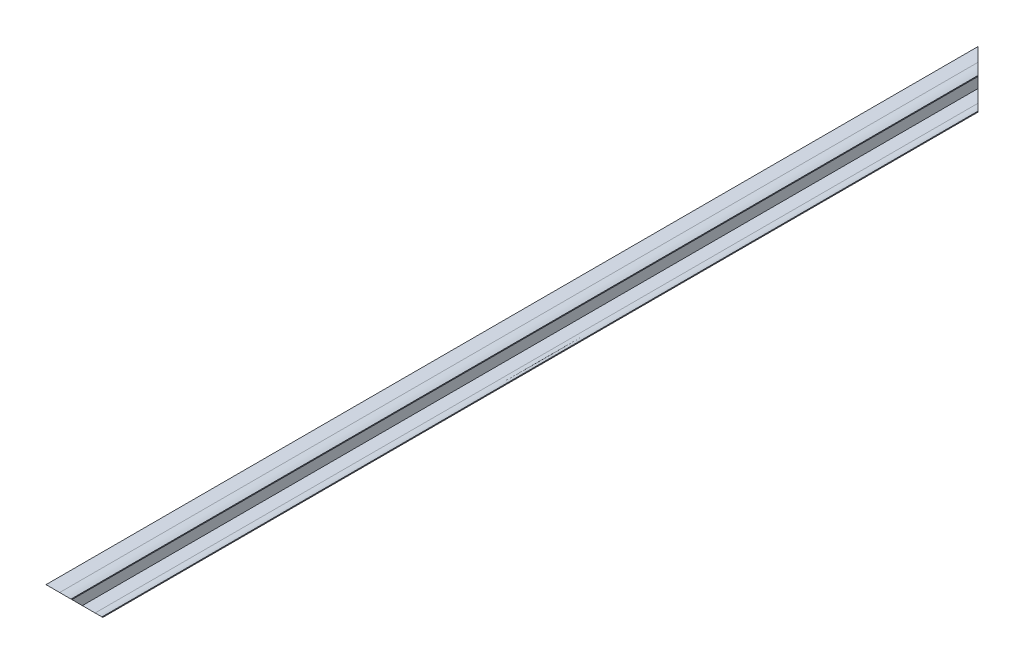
ISO-10303-21;
HEADER;
FILE_DESCRIPTION(('STEP AP214'),'2;1');
FILE_NAME('part.step','',(''),(''),'','','');
FILE_SCHEMA(('AUTOMOTIVE_DESIGN { 1 0 10303 214 1 1 1 1 }'));
ENDSEC;
DATA;
#1=APPLICATION_CONTEXT('core data for automotive mechanical design processes');
#2=APPLICATION_PROTOCOL_DEFINITION('international standard','automotive_design',2000,#1);
#3=PRODUCT_CONTEXT('',#1,'mechanical');
#4=PRODUCT('Part','Part','',(#3));
#5=PRODUCT_RELATED_PRODUCT_CATEGORY('part','',(#4));
#6=PRODUCT_DEFINITION_FORMATION('','',#4);
#7=PRODUCT_DEFINITION_CONTEXT('part definition',#1,'design');
#8=PRODUCT_DEFINITION('design','',#6,#7);
#9=PRODUCT_DEFINITION_SHAPE('','',#8);
#10=(LENGTH_UNIT() NAMED_UNIT(*) SI_UNIT(.MILLI.,.METRE.));
#11=(NAMED_UNIT(*) PLANE_ANGLE_UNIT() SI_UNIT($,.RADIAN.));
#12=(NAMED_UNIT(*) SI_UNIT($,.STERADIAN.) SOLID_ANGLE_UNIT());
#13=UNCERTAINTY_MEASURE_WITH_UNIT(LENGTH_MEASURE(1.E-05),#10,'distance_accuracy_value','');
#14=(GEOMETRIC_REPRESENTATION_CONTEXT(3) GLOBAL_UNCERTAINTY_ASSIGNED_CONTEXT((#13)) GLOBAL_UNIT_ASSIGNED_CONTEXT((#10,
#11,#12)) REPRESENTATION_CONTEXT('',''));
#15=CARTESIAN_POINT('',(0.,0.,0.));
#16=DIRECTION('',(0.,0.,1.));
#17=DIRECTION('',(1.,0.,0.));
#18=AXIS2_PLACEMENT_3D('',#15,#16,#17);
#19=CARTESIAN_POINT('',(0.,0.,2050.));
#20=DIRECTION('',(0.,1.,0.));
#21=DIRECTION('',(0.,0.,1.));
#22=AXIS2_PLACEMENT_3D('',#19,#20,#21);
#23=PLANE('',#22);
#24=DIRECTION('',(0.,0.,-1.));
#25=VECTOR('',#24,1.);
#26=CARTESIAN_POINT('',(30.,0.,2050.));
#27=LINE('',#26,#25);
#28=CARTESIAN_POINT('',(30.0000000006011,0.,1970.));
#29=VERTEX_POINT('',#28);
#30=CARTESIAN_POINT('',(30.,0.,30.0000000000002));
#31=VERTEX_POINT('',#30);
#32=EDGE_CURVE('E11',#29,#31,#27,.T.);
#33=ORIENTED_EDGE('',*,*,#32,.F.);
#34=DIRECTION('',(-1.,0.,0.));
#35=VECTOR('',#34,1.);
#36=CARTESIAN_POINT('',(50.00105,0.,1970.));
#37=LINE('',#36,#35);
#38=CARTESIAN_POINT('',(0.,0.,1970.));
#39=VERTEX_POINT('',#38);
#40=EDGE_CURVE('E137',#29,#39,#37,.T.);
#41=ORIENTED_EDGE('',*,*,#40,.T.);
#42=DIRECTION('',(0.,0.,-1.));
#43=VECTOR('',#42,1.);
#44=CARTESIAN_POINT('',(0.,0.,2050.));
#45=LINE('',#44,#43);
#46=CARTESIAN_POINT('',(0.,0.,0.));
#47=VERTEX_POINT('',#46);
#48=EDGE_CURVE('E128',#39,#47,#45,.T.);
#49=ORIENTED_EDGE('',*,*,#48,.T.);
#50=DIRECTION('',(-0.707106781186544,0.,-0.707106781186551));
#51=VECTOR('',#50,1.);
#52=CARTESIAN_POINT('',(0.,0.,0.));
#53=LINE('',#52,#51);
#54=EDGE_CURVE('E211',#31,#47,#53,.T.);
#55=ORIENTED_EDGE('',*,*,#54,.F.);
#56=EDGE_LOOP('',(#33,#41,#49,#55));
#57=FACE_BOUND('',#56,.T.);
#58=ADVANCED_FACE('F32',(#57),#23,.F.);
#59=CARTESIAN_POINT('',(30.,0.,2050.));
#60=CARTESIAN_POINT('',(40.6032812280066,0.0484567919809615,2050.));
#61=CARTESIAN_POINT('',(50.,5.,2050.));
#62=B_SPLINE_CURVE_WITH_KNOTS('',2,(#59,#60,#61),.UNSPECIFIED.,.F.,.F.,(3,3),(0.,1.),.UNSPECIFIED.);
#63=DIRECTION('',(0.,0.,-1.));
#64=VECTOR('',#63,1.);
#65=SURFACE_OF_LINEAR_EXTRUSION('',#62,#64);
#66=DIRECTION('',(0.,0.,-1.));
#67=VECTOR('',#66,1.);
#68=CARTESIAN_POINT('',(50.,5.,2050.));
#69=LINE('',#68,#67);
#70=CARTESIAN_POINT('',(50.,5.00000000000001,1975.));
#71=VERTEX_POINT('',#70);
#72=CARTESIAN_POINT('',(50.,5.,50.0000000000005));
#73=VERTEX_POINT('',#72);
#74=EDGE_CURVE('E46',#71,#73,#69,.T.);
#75=ORIENTED_EDGE('',*,*,#74,.F.);
#76=CARTESIAN_POINT('',(30.0000000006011,1.36626137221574E-12,1970.));
#77=CARTESIAN_POINT('',(30.2965221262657,0.00135208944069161,1970.00135208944));
#78=CARTESIAN_POINT('',(30.5930205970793,0.00558904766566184,1970.00558904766));
#79=CARTESIAN_POINT('',(31.1856963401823,0.0198889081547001,1970.01988890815));
#80=CARTESIAN_POINT('',(31.4818736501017,0.0299510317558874,1970.02995103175));
#81=CARTESIAN_POINT('',(32.0736889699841,0.055956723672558,1970.05595672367));
#82=CARTESIAN_POINT('',(32.3693270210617,0.0718998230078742,1970.07189982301));
#83=CARTESIAN_POINT('',(32.9597359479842,0.109694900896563,1970.1096949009));
#84=CARTESIAN_POINT('',(33.2545071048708,0.13154468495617,1970.13154468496));
#85=CARTESIAN_POINT('',(33.8430758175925,0.181175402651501,1970.18117540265));
#86=CARTESIAN_POINT('',(34.1368732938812,0.208956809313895,1970.20895680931));
#87=CARTESIAN_POINT('',(34.7232698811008,0.270449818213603,1970.27044981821));
#88=CARTESIAN_POINT('',(35.0158687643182,0.304162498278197,1970.30416249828));
#89=CARTESIAN_POINT('',(35.8889009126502,0.41384807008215,1970.41384807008));
#90=CARTESIAN_POINT('',(36.4671828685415,0.498588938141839,1970.49858893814));
#91=CARTESIAN_POINT('',(37.6162181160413,0.691147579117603,1970.69114757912));
#92=CARTESIAN_POINT('',(38.1869682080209,0.798974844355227,1970.79897484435));
#93=CARTESIAN_POINT('',(39.3191210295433,1.037016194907,1971.03701619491));
#94=CARTESIAN_POINT('',(39.8805226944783,1.16723281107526,1971.16723281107));
#95=CARTESIAN_POINT('',(40.9934871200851,1.44938335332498,1971.44938335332));
#96=CARTESIAN_POINT('',(41.5450291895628,1.60135802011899,1971.60135802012));
#97=CARTESIAN_POINT('',(42.6358830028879,1.92568946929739,1971.9256894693));
#98=CARTESIAN_POINT('',(43.1751963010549,2.09804364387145,1972.09804364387));
#99=CARTESIAN_POINT('',(44.240610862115,2.46185600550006,1972.4618560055));
#100=CARTESIAN_POINT('',(44.7667154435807,2.65330933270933,1972.65330933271));
#101=CARTESIAN_POINT('',(45.5602041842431,2.95948974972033,1972.95948974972));
#102=CARTESIAN_POINT('',(45.8325761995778,3.06781364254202,1973.06781364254));
#103=CARTESIAN_POINT('',(46.3733730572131,3.289211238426,1973.28921123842));
#104=CARTESIAN_POINT('',(46.6417986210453,3.40228405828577,1973.40228405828));
#105=CARTESIAN_POINT('',(47.1746722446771,3.63298659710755,1973.63298659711));
#106=CARTESIAN_POINT('',(47.4391205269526,3.75061605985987,1973.75061605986));
#107=CARTESIAN_POINT('',(48.4854647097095,4.22828118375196,1974.22828118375));
#108=CARTESIAN_POINT('',(49.2516390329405,4.60563986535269,1974.60563986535));
#109=CARTESIAN_POINT('',(50.,4.99999999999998,1975.));
#110=B_SPLINE_CURVE_WITH_KNOTS('',3,(#76,#77,#78,#79,#80,#81,#82,#83,#84,#85,#86,#87,#88,#89,
#90,#91,#92,#93,#94,#95,#96,#97,#98,#99,#100,#101,#102,#103,#104,#105,#106,#107,#108,#109),
.UNSPECIFIED.,.F.,.F.,(4,2,2,2,2,2,2,2,2,2,2,2,2,2,2,2,4),(0.,0.889560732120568,
1.77900258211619,2.66837351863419,3.5574144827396,4.44652637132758,5.33579999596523,
7.10646365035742,8.87785674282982,10.6494502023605,12.424405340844,14.199133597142,
15.9734114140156,16.9108234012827,17.8480618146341,18.785247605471,21.5842762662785),.UNSPECIFIED.);
#111=EDGE_CURVE('E160',#29,#71,#110,.T.);
#112=ORIENTED_EDGE('',*,*,#111,.F.);
#113=ORIENTED_EDGE('',*,*,#32,.T.);
#114=CARTESIAN_POINT('',(50.,4.99999999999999,50.0000000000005));
#115=CARTESIAN_POINT('',(49.4114796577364,4.68985586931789,49.4114796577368));
#116=CARTESIAN_POINT('',(48.8191807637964,4.39406911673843,48.8191807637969));
#117=CARTESIAN_POINT('',(47.6277425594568,3.83146471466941,47.6277425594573));
#118=CARTESIAN_POINT('',(47.0286032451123,3.56464708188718,47.0286032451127));
#119=CARTESIAN_POINT('',(45.8245910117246,3.06039872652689,45.824591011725));
#120=CARTESIAN_POINT('',(45.219722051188,2.82294911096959,45.2197220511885));
#121=CARTESIAN_POINT('',(44.0046502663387,2.37731903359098,44.0046502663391));
#122=CARTESIAN_POINT('',(43.394447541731,2.1691380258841,43.3944475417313));
#123=CARTESIAN_POINT('',(41.7405628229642,1.64647116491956,41.7405628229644));
#124=CARTESIAN_POINT('',(40.6924545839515,1.35958497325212,40.6924545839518));
#125=CARTESIAN_POINT('',(38.5864777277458,0.869149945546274,38.5864777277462));
#126=CARTESIAN_POINT('',(37.5286076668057,0.665613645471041,37.5286076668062));
#127=CARTESIAN_POINT('',(35.3936831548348,0.337784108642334,35.3936831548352));
#128=CARTESIAN_POINT('',(34.31655192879,0.214485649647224,34.3165519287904));
#129=CARTESIAN_POINT('',(32.6988221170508,0.0896672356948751,32.6988221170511));
#130=CARTESIAN_POINT('',(32.1592904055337,0.0580827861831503,32.159290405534));
#131=CARTESIAN_POINT('',(31.0798528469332,0.0144826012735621,31.0798528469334));
#132=CARTESIAN_POINT('',(30.5399470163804,0.00246605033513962,30.5399470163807));
#133=CARTESIAN_POINT('',(30.,0.,30.0000000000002));
#134=B_SPLINE_CURVE_WITH_KNOTS('',3,(#114,#115,#116,#117,#118,#119,#120,#121,#122,#123,#124,
#125,#126,#127,#128,#129,#130,#131,#132,#133),.UNSPECIFIED.,.F.,.F.,(4,2,2,2,2,2,2,2,2,4),(0.,
2.66446206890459,5.32892567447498,7.99166616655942,10.6543569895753,15.1809940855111,
19.7083117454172,24.2907399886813,26.5815270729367,28.8722186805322),.UNSPECIFIED.);
#135=EDGE_CURVE('E208',#73,#31,#134,.T.);
#136=ORIENTED_EDGE('',*,*,#135,.F.);
#137=EDGE_LOOP('',(#75,#112,#113,#136));
#138=FACE_BOUND('',#137,.T.);
#139=ADVANCED_FACE('F337',(#138),#65,.F.);
#140=CARTESIAN_POINT('',(50.,5.,2050.));
#141=DIRECTION('',(-1.,0.,0.));
#142=DIRECTION('',(0.,0.,1.));
#143=AXIS2_PLACEMENT_3D('',#140,#141,#142);
#144=PLANE('',#143);
#145=DIRECTION('',(0.,0.,-1.));
#146=VECTOR('',#145,1.);
#147=CARTESIAN_POINT('',(50.,7.00000000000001,2050.));
#148=LINE('',#147,#146);
#149=CARTESIAN_POINT('',(50.,7.00000000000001,1977.));
#150=VERTEX_POINT('',#149);
#151=CARTESIAN_POINT('',(50.,7.,50.0000000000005));
#152=VERTEX_POINT('',#151);
#153=EDGE_CURVE('E314',#150,#152,#148,.T.);
#154=ORIENTED_EDGE('',*,*,#153,.F.);
#155=DIRECTION('',(0.,0.707106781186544,0.707106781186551));
#156=VECTOR('',#155,1.);
#157=CARTESIAN_POINT('',(50.,80.,2050.));
#158=LINE('',#157,#156);
#159=EDGE_CURVE('E282',#71,#150,#158,.T.);
#160=ORIENTED_EDGE('',*,*,#159,.F.);
#161=ORIENTED_EDGE('',*,*,#74,.T.);
#162=DIRECTION('',(0.,1.,0.));
#163=VECTOR('',#162,1.);
#164=CARTESIAN_POINT('',(50.,-0.001000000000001,50.0000000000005));
#165=LINE('',#164,#163);
#166=EDGE_CURVE('E201',#73,#152,#165,.T.);
#167=ORIENTED_EDGE('',*,*,#166,.T.);
#168=EDGE_LOOP('',(#154,#160,#161,#167));
#169=FACE_BOUND('',#168,.T.);
#170=ADVANCED_FACE('F334',(#169),#144,.F.);
#171=CARTESIAN_POINT('',(50.,7.00000000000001,2050.));
#172=CARTESIAN_POINT('',(40.6032812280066,2.04845679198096,2050.));
#173=CARTESIAN_POINT('',(30.,2.,2050.));
#174=B_SPLINE_CURVE_WITH_KNOTS('',2,(#171,#172,#173),.UNSPECIFIED.,.F.,.F.,(3,3),(0.,1.),.UNSPECIFIED.);
#175=DIRECTION('',(0.,0.,-1.));
#176=VECTOR('',#175,1.);
#177=SURFACE_OF_LINEAR_EXTRUSION('',#174,#176);
#178=DIRECTION('',(0.,0.,-1.));
#179=VECTOR('',#178,1.);
#180=CARTESIAN_POINT('',(30.,2.,2050.));
#181=LINE('',#180,#179);
#182=CARTESIAN_POINT('',(30.,2.,1972.));
#183=VERTEX_POINT('',#182);
#184=CARTESIAN_POINT('',(30.,2.,30.0000000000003));
#185=VERTEX_POINT('',#184);
#186=EDGE_CURVE('E312',#183,#185,#181,.T.);
#187=ORIENTED_EDGE('',*,*,#186,.F.);
#188=CARTESIAN_POINT('',(50.,7.00000000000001,1977.));
#189=CARTESIAN_POINT('',(49.5210550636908,6.74761460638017,1976.74761460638));
#190=CARTESIAN_POINT('',(49.034728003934,6.50214773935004,1976.50214773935));
#191=CARTESIAN_POINT('',(48.0467010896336,6.02606279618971,1976.02606279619));
#192=CARTESIAN_POINT('',(47.5449794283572,5.7954673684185,1975.79546736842));
#193=CARTESIAN_POINT('',(46.52672911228,5.35078644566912,1975.35078644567));
#194=CARTESIAN_POINT('',(46.0101932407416,5.13670919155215,1975.13670919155));
#195=CARTESIAN_POINT('',(44.9634416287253,4.72679072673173,1974.72679072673));
#196=CARTESIAN_POINT('',(44.4332389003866,4.53093293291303,1974.53093293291));
#197=CARTESIAN_POINT('',(43.3596325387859,4.15871016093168,1974.15871016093));
#198=CARTESIAN_POINT('',(42.8162357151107,3.98233537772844,1973.98233537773));
#199=CARTESIAN_POINT('',(41.7171702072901,3.65035131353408,1973.65035131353));
#200=CARTESIAN_POINT('',(41.1615076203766,3.49473197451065,1973.49473197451));
#201=CARTESIAN_POINT('',(40.1825845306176,3.24237137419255,1973.24237137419));
#202=CARTESIAN_POINT('',(39.7618260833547,3.14075340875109,1973.14075340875));
#203=CARTESIAN_POINT('',(38.9146879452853,2.95002496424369,1972.95002496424));
#204=CARTESIAN_POINT('',(38.4883085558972,2.86091381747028,1972.86091381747));
#205=CARTESIAN_POINT('',(37.6310401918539,2.69562554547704,1972.69562554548));
#206=CARTESIAN_POINT('',(37.2001563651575,2.61943507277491,1972.61943507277));
#207=CARTESIAN_POINT('',(36.3341748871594,2.4801321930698,1972.48013219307));
#208=CARTESIAN_POINT('',(35.8990771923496,2.41701992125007,1972.41701992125));
#209=CARTESIAN_POINT('',(35.0123765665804,2.30235066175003,1972.30235066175));
#210=CARTESIAN_POINT('',(34.5606694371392,2.25119612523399,1972.25119612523));
#211=CARTESIAN_POINT('',(33.6544975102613,2.16301119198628,1972.16301119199));
#212=CARTESIAN_POINT('',(33.2000326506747,2.12598111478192,1972.12598111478));
#213=CARTESIAN_POINT('',(32.2884626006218,2.0659644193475,1972.06596441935));
#214=CARTESIAN_POINT('',(31.831354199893,2.04300224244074,1972.04300224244));
#215=CARTESIAN_POINT('',(30.9161801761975,2.01105819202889,1972.01105819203));
#216=CARTESIAN_POINT('',(30.4581145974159,2.00207568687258,1972.00207568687));
#217=CARTESIAN_POINT('',(30.,2.00000000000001,1972.));
#218=B_SPLINE_CURVE_WITH_KNOTS('',3,(#188,#189,#190,#191,#192,#193,#194,#195,#196,#197,#198,
#199,#200,#201,#202,#203,#204,#205,#206,#207,#208,#209,#210,#211,#212,#213,#214,#215,#216,#217),
.UNSPECIFIED.,.F.,.F.,(4,2,2,2,2,2,2,2,2,2,2,2,2,2,4),(0.,1.79192712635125,3.58652177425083,
5.38200602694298,7.17583972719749,8.96876650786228,10.7608212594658,12.094332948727,
13.4277734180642,14.759827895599,16.0918961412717,17.463838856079,18.8358126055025,
20.2101632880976,21.5844518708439),.UNSPECIFIED.);
#219=EDGE_CURVE('E284',#150,#183,#218,.T.);
#220=ORIENTED_EDGE('',*,*,#219,.F.);
#221=ORIENTED_EDGE('',*,*,#153,.T.);
#222=CARTESIAN_POINT('',(30.,2.,30.0000000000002));
#223=CARTESIAN_POINT('',(30.6272946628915,2.00285611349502,30.6272946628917));
#224=CARTESIAN_POINT('',(31.2545746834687,2.01861799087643,31.254574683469));
#225=CARTESIAN_POINT('',(32.5085722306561,2.07665376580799,32.5085722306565));
#226=CARTESIAN_POINT('',(33.1352897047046,2.11892992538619,33.1352897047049));
#227=CARTESIAN_POINT('',(34.3876637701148,2.23070718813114,34.3876637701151));
#228=CARTESIAN_POINT('',(35.0133200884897,2.30021446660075,35.01332008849));
#229=CARTESIAN_POINT('',(36.2627376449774,2.46704639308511,36.2627376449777));
#230=CARTESIAN_POINT('',(36.8864989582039,2.56436992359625,36.8864989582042));
#231=CARTESIAN_POINT('',(38.5675300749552,2.86547237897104,38.5675300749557));
#232=CARTESIAN_POINT('',(39.6224623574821,3.09607135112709,39.6224623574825));
#233=CARTESIAN_POINT('',(41.7212568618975,3.64106978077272,41.7212568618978));
#234=CARTESIAN_POINT('',(42.7651214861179,3.95545064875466,42.765121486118));
#235=CARTESIAN_POINT('',(44.3267724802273,4.4927596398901,44.3267724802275));
#236=CARTESIAN_POINT('',(44.8500436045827,4.68429385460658,44.8500436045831));
#237=CARTESIAN_POINT('',(45.892392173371,5.08904722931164,45.8923921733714));
#238=CARTESIAN_POINT('',(46.4114696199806,5.30226637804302,46.4114696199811));
#239=CARTESIAN_POINT('',(47.4451599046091,5.75040246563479,47.4451599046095));
#240=CARTESIAN_POINT('',(47.9597707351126,5.98532865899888,47.959770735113));
#241=CARTESIAN_POINT('',(48.9838539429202,6.47662567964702,48.9838539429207));
#242=CARTESIAN_POINT('',(49.4933262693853,6.7329967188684,49.4933262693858));
#243=CARTESIAN_POINT('',(50.,7.00000000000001,50.0000000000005));
#244=B_SPLINE_CURVE_WITH_KNOTS('',3,(#222,#223,#224,#225,#226,#227,#228,#229,#230,#231,#232,
#233,#234,#235,#236,#237,#238,#239,#240,#241,#242,#243),.UNSPECIFIED.,.F.,.F.,(4,2,2,2,2,2,2,2,
2,2,4),(0.,2.66133520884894,5.32289749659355,7.98506370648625,10.6471229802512,15.1735338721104,
19.6989412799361,21.9918706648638,24.2847988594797,26.5787091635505,28.8726421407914),.UNSPECIFIED.);
#245=EDGE_CURVE('E212',#185,#152,#244,.T.);
#246=ORIENTED_EDGE('',*,*,#245,.F.);
#247=EDGE_LOOP('',(#187,#220,#221,#246));
#248=FACE_BOUND('',#247,.T.);
#249=ADVANCED_FACE('F376',(#248),#177,.F.);
#250=CARTESIAN_POINT('',(2.,2.,2050.));
#251=DIRECTION('',(0.,-1.,0.));
#252=DIRECTION('',(0.,0.,-1.));
#253=AXIS2_PLACEMENT_3D('',#250,#251,#252);
#254=PLANE('',#253);
#255=DIRECTION('',(0.,0.,-1.));
#256=VECTOR('',#255,1.);
#257=CARTESIAN_POINT('',(2.,2.,2050.));
#258=LINE('',#257,#256);
#259=CARTESIAN_POINT('',(2.,2.,1972.));
#260=VERTEX_POINT('',#259);
#261=CARTESIAN_POINT('',(2.,2.,2.00000000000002));
#262=VERTEX_POINT('',#261);
#263=EDGE_CURVE('E305',#260,#262,#258,.T.);
#264=ORIENTED_EDGE('',*,*,#263,.F.);
#265=DIRECTION('',(-1.,0.,0.));
#266=VECTOR('',#265,1.);
#267=CARTESIAN_POINT('',(50.00105,2.,1972.));
#268=LINE('',#267,#266);
#269=EDGE_CURVE('E236',#183,#260,#268,.T.);
#270=ORIENTED_EDGE('',*,*,#269,.F.);
#271=ORIENTED_EDGE('',*,*,#186,.T.);
#272=DIRECTION('',(0.707106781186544,0.,0.707106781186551));
#273=VECTOR('',#272,1.);
#274=CARTESIAN_POINT('',(0.,2.,0.));
#275=LINE('',#274,#273);
#276=EDGE_CURVE('E311',#262,#185,#275,.T.);
#277=ORIENTED_EDGE('',*,*,#276,.F.);
#278=EDGE_LOOP('',(#264,#270,#271,#277));
#279=FACE_BOUND('',#278,.T.);
#280=ADVANCED_FACE('F309',(#279),#254,.F.);
#281=CARTESIAN_POINT('',(2.,78.,2050.));
#282=DIRECTION('',(-1.,0.,0.));
#283=DIRECTION('',(0.,0.,1.));
#284=AXIS2_PLACEMENT_3D('',#281,#282,#283);
#285=PLANE('',#284);
#286=DIRECTION('',(0.,0.,-1.));
#287=VECTOR('',#286,1.);
#288=CARTESIAN_POINT('',(2.,78.,2050.));
#289=LINE('',#288,#287);
#290=CARTESIAN_POINT('',(2.,78.,2048.));
#291=VERTEX_POINT('',#290);
#292=CARTESIAN_POINT('',(2.,78.,2.00000000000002));
#293=VERTEX_POINT('',#292);
#294=EDGE_CURVE('E307',#291,#293,#289,.T.);
#295=ORIENTED_EDGE('',*,*,#294,.F.);
#296=DIRECTION('',(0.,0.707106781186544,0.707106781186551));
#297=VECTOR('',#296,1.);
#298=CARTESIAN_POINT('',(2.,80.,2050.));
#299=LINE('',#298,#297);
#300=EDGE_CURVE('E226',#260,#291,#299,.T.);
#301=ORIENTED_EDGE('',*,*,#300,.F.);
#302=ORIENTED_EDGE('',*,*,#263,.T.);
#303=DIRECTION('',(0.,-1.,0.));
#304=VECTOR('',#303,1.);
#305=CARTESIAN_POINT('',(2.,-0.001000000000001,2.00000000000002));
#306=LINE('',#305,#304);
#307=EDGE_CURVE('E194',#293,#262,#306,.T.);
#308=ORIENTED_EDGE('',*,*,#307,.F.);
#309=EDGE_LOOP('',(#295,#301,#302,#308));
#310=FACE_BOUND('',#309,.T.);
#311=ADVANCED_FACE('F303',(#310),#285,.F.);
#312=CARTESIAN_POINT('',(2.,78.,2050.));
#313=DIRECTION('',(0.,1.,0.));
#314=DIRECTION('',(0.,0.,1.));
#315=AXIS2_PLACEMENT_3D('',#312,#313,#314);
#316=PLANE('',#315);
#317=DIRECTION('',(0.,0.,-1.));
#318=VECTOR('',#317,1.);
#319=CARTESIAN_POINT('',(30.,78.,2050.));
#320=LINE('',#319,#318);
#321=CARTESIAN_POINT('',(30.,78.,2048.));
#322=VERTEX_POINT('',#321);
#323=CARTESIAN_POINT('',(30.,78.,30.0000000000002));
#324=VERTEX_POINT('',#323);
#325=EDGE_CURVE('E316',#322,#324,#320,.T.);
#326=ORIENTED_EDGE('',*,*,#325,.F.);
#327=DIRECTION('',(1.,0.,0.));
#328=VECTOR('',#327,1.);
#329=CARTESIAN_POINT('',(50.00105,78.,2048.));
#330=LINE('',#329,#328);
#331=EDGE_CURVE('E237',#291,#322,#330,.T.);
#332=ORIENTED_EDGE('',*,*,#331,.F.);
#333=ORIENTED_EDGE('',*,*,#294,.T.);
#334=DIRECTION('',(-0.707106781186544,0.,-0.707106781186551));
#335=VECTOR('',#334,1.);
#336=CARTESIAN_POINT('',(0.,78.,0.));
#337=LINE('',#336,#335);
#338=EDGE_CURVE('E486',#324,#293,#337,.T.);
#339=ORIENTED_EDGE('',*,*,#338,.F.);
#340=EDGE_LOOP('',(#326,#332,#333,#339));
#341=FACE_BOUND('',#340,.T.);
#342=ADVANCED_FACE('F367',(#341),#316,.F.);
#343=CARTESIAN_POINT('',(30.,78.,2050.));
#344=CARTESIAN_POINT('',(40.6032812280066,77.951543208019,2050.));
#345=CARTESIAN_POINT('',(50.,73.,2050.));
#346=B_SPLINE_CURVE_WITH_KNOTS('',2,(#343,#344,#345),.UNSPECIFIED.,.F.,.F.,(3,3),(0.,1.),.UNSPECIFIED.);
#347=DIRECTION('',(0.,0.,-1.));
#348=VECTOR('',#347,1.);
#349=SURFACE_OF_LINEAR_EXTRUSION('',#346,#348);
#350=DIRECTION('',(0.,0.,-1.));
#351=VECTOR('',#350,1.);
#352=CARTESIAN_POINT('',(50.,73.,2050.));
#353=LINE('',#352,#351);
#354=CARTESIAN_POINT('',(50.,73.,2043.));
#355=VERTEX_POINT('',#354);
#356=CARTESIAN_POINT('',(50.,73.,50.0000000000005));
#357=VERTEX_POINT('',#356);
#358=EDGE_CURVE('E509',#355,#357,#353,.T.);
#359=ORIENTED_EDGE('',*,*,#358,.F.);
#360=CARTESIAN_POINT('',(30.,78.,2048.));
#361=CARTESIAN_POINT('',(30.2965221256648,77.9986479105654,2047.99864791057));
#362=CARTESIAN_POINT('',(30.5930205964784,77.9944109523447,2047.99441095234));
#363=CARTESIAN_POINT('',(31.1856963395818,77.9801110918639,2047.98011109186));
#364=CARTESIAN_POINT('',(31.4818736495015,77.9700489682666,2047.97004896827));
#365=CARTESIAN_POINT('',(32.0736889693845,77.9440432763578,2047.94404327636));
#366=CARTESIAN_POINT('',(32.3693270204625,77.9281001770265,2047.92810017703));
#367=CARTESIAN_POINT('',(32.959735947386,77.8903050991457,2047.89030509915));
#368=CARTESIAN_POINT('',(33.2545071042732,77.8684553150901,2047.86845531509));
#369=CARTESIAN_POINT('',(33.8430758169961,77.8188245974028,2047.8188245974));
#370=CARTESIAN_POINT('',(34.1368732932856,77.7910431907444,2047.79104319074));
#371=CARTESIAN_POINT('',(34.7232698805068,77.7295501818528,2047.72955018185));
#372=CARTESIAN_POINT('',(35.0158687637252,77.6958375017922,2047.69583750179));
#373=CARTESIAN_POINT('',(35.8889009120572,77.5861519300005,2047.58615193));
#374=CARTESIAN_POINT('',(36.467182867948,77.5014110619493,2047.50141106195));
#375=CARTESIAN_POINT('',(37.6162181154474,77.3088524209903,2047.30885242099));
#376=CARTESIAN_POINT('',(38.186968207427,77.2010251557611,2047.20102515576));
#377=CARTESIAN_POINT('',(39.3191210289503,76.9629838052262,2046.96298380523));
#378=CARTESIAN_POINT('',(39.8805226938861,76.8327671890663,2046.83276718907));
#379=CARTESIAN_POINT('',(40.9934871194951,76.5506166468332,2046.55061664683));
#380=CARTESIAN_POINT('',(41.5450291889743,76.3986419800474,2046.39864198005));
#381=CARTESIAN_POINT('',(42.6358830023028,76.0743105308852,2046.07431053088));
#382=CARTESIAN_POINT('',(43.1751963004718,75.9019563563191,2045.90195635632));
#383=CARTESIAN_POINT('',(44.2406108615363,75.5381439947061,2045.53814399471));
#384=CARTESIAN_POINT('',(44.7667154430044,75.3466906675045,2045.3466906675));
#385=CARTESIAN_POINT('',(45.5602041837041,75.0405102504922,2045.04051025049));
#386=CARTESIAN_POINT('',(45.832576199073,74.932186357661,2044.93218635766));
#387=CARTESIAN_POINT('',(46.3733730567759,74.7107887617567,2044.71078876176));
#388=CARTESIAN_POINT('',(46.6417986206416,74.5977159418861,2044.59771594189));
#389=CARTESIAN_POINT('',(47.1746722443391,74.3670134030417,2044.36701340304));
#390=CARTESIAN_POINT('',(47.439120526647,74.2493839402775,2044.24938394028));
#391=CARTESIAN_POINT('',(48.4854647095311,73.7717188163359,2043.77171881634));
#392=CARTESIAN_POINT('',(49.2516390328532,73.3943601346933,2043.39436013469));
#393=CARTESIAN_POINT('',(50.,73.,2043.));
#394=B_SPLINE_CURVE_WITH_KNOTS('',3,(#360,#361,#362,#363,#364,#365,#366,#367,#368,#369,#370,
#371,#372,#373,#374,#375,#376,#377,#378,#379,#380,#381,#382,#383,#384,#385,#386,#387,#388,#389,
#390,#391,#392,#393),.UNSPECIFIED.,.F.,.F.,(4,2,2,2,2,2,2,2,2,2,2,2,2,2,2,2,4),(0.,
0.889560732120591,1.77900258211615,2.66837351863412,3.55741448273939,4.44652637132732,
5.33579999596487,7.10646365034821,8.87785674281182,10.6494502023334,12.4244053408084,
14.1991335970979,15.9734114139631,16.9108234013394,17.8480618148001,18.7852476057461,
21.5842762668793),.UNSPECIFIED.);
#395=EDGE_CURVE('E262',#322,#355,#394,.T.);
#396=ORIENTED_EDGE('',*,*,#395,.F.);
#397=ORIENTED_EDGE('',*,*,#325,.T.);
#398=CARTESIAN_POINT('',(50.,73.,50.0000000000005));
#399=CARTESIAN_POINT('',(49.4114796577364,73.3101441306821,49.4114796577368));
#400=CARTESIAN_POINT('',(48.8191807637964,73.6059308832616,48.8191807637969));
#401=CARTESIAN_POINT('',(47.6277425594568,74.1685352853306,47.6277425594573));
#402=CARTESIAN_POINT('',(47.0286032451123,74.4353529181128,47.0286032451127));
#403=CARTESIAN_POINT('',(45.8245910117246,74.9396012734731,45.824591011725));
#404=CARTESIAN_POINT('',(45.219722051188,75.1770508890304,45.2197220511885));
#405=CARTESIAN_POINT('',(44.0046502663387,75.622680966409,44.0046502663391));
#406=CARTESIAN_POINT('',(43.394447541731,75.8308619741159,43.3944475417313));
#407=CARTESIAN_POINT('',(41.7405628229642,76.3535288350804,41.7405628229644));
#408=CARTESIAN_POINT('',(40.6924545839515,76.6404150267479,40.6924545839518));
#409=CARTESIAN_POINT('',(38.5864777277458,77.1308500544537,38.5864777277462));
#410=CARTESIAN_POINT('',(37.5286076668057,77.334386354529,37.5286076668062));
#411=CARTESIAN_POINT('',(35.3936831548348,77.6622158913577,35.3936831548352));
#412=CARTESIAN_POINT('',(34.31655192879,77.7855143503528,34.3165519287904));
#413=CARTESIAN_POINT('',(32.6988221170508,77.9103327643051,32.6988221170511));
#414=CARTESIAN_POINT('',(32.1592904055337,77.9419172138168,32.159290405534));
#415=CARTESIAN_POINT('',(31.0798528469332,77.9855173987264,31.0798528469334));
#416=CARTESIAN_POINT('',(30.5399470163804,77.9975339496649,30.5399470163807));
#417=CARTESIAN_POINT('',(30.,78.,30.0000000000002));
#418=B_SPLINE_CURVE_WITH_KNOTS('',3,(#398,#399,#400,#401,#402,#403,#404,#405,#406,#407,#408,
#409,#410,#411,#412,#413,#414,#415,#416,#417),.UNSPECIFIED.,.F.,.F.,(4,2,2,2,2,2,2,2,2,4),(0.,
2.6644620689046,5.32892567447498,7.99166616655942,10.6543569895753,15.1809940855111,
19.7083117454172,24.2907399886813,26.5815270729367,28.8722186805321),.UNSPECIFIED.);
#419=EDGE_CURVE('E205',#357,#324,#418,.T.);
#420=ORIENTED_EDGE('',*,*,#419,.F.);
#421=EDGE_LOOP('',(#359,#396,#397,#420));
#422=FACE_BOUND('',#421,.T.);
#423=ADVANCED_FACE('F363',(#422),#349,.F.);
#424=CARTESIAN_POINT('',(50.,75.,2050.));
#425=DIRECTION('',(-1.,0.,0.));
#426=DIRECTION('',(0.,0.,1.));
#427=AXIS2_PLACEMENT_3D('',#424,#425,#426);
#428=PLANE('',#427);
#429=DIRECTION('',(0.,0.,-1.));
#430=VECTOR('',#429,1.);
#431=CARTESIAN_POINT('',(50.,75.,2050.));
#432=LINE('',#431,#430);
#433=CARTESIAN_POINT('',(50.,75.,2045.));
#434=VERTEX_POINT('',#433);
#435=CARTESIAN_POINT('',(50.,75.,50.0000000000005));
#436=VERTEX_POINT('',#435);
#437=EDGE_CURVE('E144',#434,#436,#432,.T.);
#438=ORIENTED_EDGE('',*,*,#437,.F.);
#439=DIRECTION('',(0.,0.707106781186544,0.707106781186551));
#440=VECTOR('',#439,1.);
#441=CARTESIAN_POINT('',(50.,80.,2050.));
#442=LINE('',#441,#440);
#443=EDGE_CURVE('E267',#355,#434,#442,.T.);
#444=ORIENTED_EDGE('',*,*,#443,.F.);
#445=ORIENTED_EDGE('',*,*,#358,.T.);
#446=EDGE_CURVE('E198',#357,#436,#165,.T.);
#447=ORIENTED_EDGE('',*,*,#446,.T.);
#448=EDGE_LOOP('',(#438,#444,#445,#447));
#449=FACE_BOUND('',#448,.T.);
#450=ADVANCED_FACE('F359',(#449),#428,.F.);
#451=CARTESIAN_POINT('',(50.,75.,2050.));
#452=CARTESIAN_POINT('',(40.6032812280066,79.951543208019,2050.));
#453=CARTESIAN_POINT('',(30.,80.,2050.));
#454=B_SPLINE_CURVE_WITH_KNOTS('',2,(#451,#452,#453),.UNSPECIFIED.,.F.,.F.,(3,3),(0.,1.),.UNSPECIFIED.);
#455=DIRECTION('',(0.,0.,-1.));
#456=VECTOR('',#455,1.);
#457=SURFACE_OF_LINEAR_EXTRUSION('',#454,#456);
#458=DIRECTION('',(0.,0.,-1.));
#459=VECTOR('',#458,1.);
#460=CARTESIAN_POINT('',(30.,80.,2050.));
#461=LINE('',#460,#459);
#462=CARTESIAN_POINT('',(30.,80.,2050.));
#463=VERTEX_POINT('',#462);
#464=CARTESIAN_POINT('',(30.,80.,30.0000000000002));
#465=VERTEX_POINT('',#464);
#466=EDGE_CURVE('E142',#463,#465,#461,.T.);
#467=ORIENTED_EDGE('',*,*,#466,.F.);
#468=CARTESIAN_POINT('',(50.,75.,2045.));
#469=CARTESIAN_POINT('',(49.5210550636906,75.2523853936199,2045.25238539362));
#470=CARTESIAN_POINT('',(49.0347280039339,75.49785226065,2045.49785226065));
#471=CARTESIAN_POINT('',(48.0467010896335,75.9739372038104,2045.97393720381));
#472=CARTESIAN_POINT('',(47.5449794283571,76.2045326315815,2046.20453263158));
#473=CARTESIAN_POINT('',(46.5267291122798,76.6492135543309,2046.64921355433));
#474=CARTESIAN_POINT('',(46.0101932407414,76.8632908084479,2046.86329080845));
#475=CARTESIAN_POINT('',(44.9634416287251,77.2732092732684,2047.27320927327));
#476=CARTESIAN_POINT('',(44.4332389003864,77.4690670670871,2047.46906706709));
#477=CARTESIAN_POINT('',(43.3596325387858,77.8412898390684,2047.84128983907));
#478=CARTESIAN_POINT('',(42.8162357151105,78.0176646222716,2048.01766462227));
#479=CARTESIAN_POINT('',(41.71717020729,78.3496486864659,2048.34964868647));
#480=CARTESIAN_POINT('',(41.1615076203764,78.5052680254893,2048.50526802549));
#481=CARTESIAN_POINT('',(40.1825845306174,78.7576286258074,2048.75762862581));
#482=CARTESIAN_POINT('',(39.7618260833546,78.8592465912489,2048.85924659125));
#483=CARTESIAN_POINT('',(38.9146879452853,79.0499750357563,2049.04997503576));
#484=CARTESIAN_POINT('',(38.4883085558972,79.1390861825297,2049.13908618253));
#485=CARTESIAN_POINT('',(37.631040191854,79.3043744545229,2049.30437445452));
#486=CARTESIAN_POINT('',(37.2001563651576,79.3805649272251,2049.38056492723));
#487=CARTESIAN_POINT('',(36.3341748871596,79.5198678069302,2049.51986780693));
#488=CARTESIAN_POINT('',(35.8990771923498,79.58298007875,2049.58298007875));
#489=CARTESIAN_POINT('',(35.0123765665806,79.6976493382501,2049.69764933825));
#490=CARTESIAN_POINT('',(34.5606694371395,79.748803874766,2049.74880387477));
#491=CARTESIAN_POINT('',(33.6544975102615,79.8369888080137,2049.83698880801));
#492=CARTESIAN_POINT('',(33.2000326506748,79.8740188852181,2049.87401888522));
#493=CARTESIAN_POINT('',(32.2884626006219,79.9340355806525,2049.93403558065));
#494=CARTESIAN_POINT('',(31.8313541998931,79.9569977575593,2049.95699775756));
#495=CARTESIAN_POINT('',(30.9161801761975,79.9889418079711,2049.98894180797));
#496=CARTESIAN_POINT('',(30.4581145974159,79.9979243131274,2049.99792431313));
#497=CARTESIAN_POINT('',(30.,80.,2050.));
#498=B_SPLINE_CURVE_WITH_KNOTS('',3,(#468,#469,#470,#471,#472,#473,#474,#475,#476,#477,#478,
#479,#480,#481,#482,#483,#484,#485,#486,#487,#488,#489,#490,#491,#492,#493,#494,#495,#496,#497),
.UNSPECIFIED.,.F.,.F.,(4,2,2,2,2,2,2,2,2,2,2,2,2,2,4),(0.,1.79192712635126,3.58652177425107,
5.38200602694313,7.17583972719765,8.96876650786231,10.760821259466,12.0943329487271,
13.4277734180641,14.7598278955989,16.0918961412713,17.4638388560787,18.8358126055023,
20.2101632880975,21.5844518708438),.UNSPECIFIED.);
#499=EDGE_CURVE('E53',#434,#463,#498,.T.);
#500=ORIENTED_EDGE('',*,*,#499,.F.);
#501=ORIENTED_EDGE('',*,*,#437,.T.);
#502=CARTESIAN_POINT('',(30.,80.,30.0000000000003));
#503=CARTESIAN_POINT('',(30.6272946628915,79.997143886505,30.6272946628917));
#504=CARTESIAN_POINT('',(31.2545746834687,79.9813820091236,31.254574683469));
#505=CARTESIAN_POINT('',(32.5085722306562,79.923346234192,32.5085722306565));
#506=CARTESIAN_POINT('',(33.1352897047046,79.8810700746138,33.1352897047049));
#507=CARTESIAN_POINT('',(34.3876637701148,79.7692928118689,34.3876637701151));
#508=CARTESIAN_POINT('',(35.0133200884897,79.6997855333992,35.01332008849));
#509=CARTESIAN_POINT('',(36.2627376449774,79.5329536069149,36.2627376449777));
#510=CARTESIAN_POINT('',(36.8864989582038,79.4356300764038,36.8864989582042));
#511=CARTESIAN_POINT('',(38.5675300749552,79.134527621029,38.5675300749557));
#512=CARTESIAN_POINT('',(39.6224623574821,78.9039286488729,39.6224623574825));
#513=CARTESIAN_POINT('',(41.7212568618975,78.3589302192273,41.7212568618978));
#514=CARTESIAN_POINT('',(42.7651214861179,78.0445493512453,42.765121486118));
#515=CARTESIAN_POINT('',(44.3267724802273,77.5072403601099,44.3267724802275));
#516=CARTESIAN_POINT('',(44.8500436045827,77.3157061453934,44.8500436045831));
#517=CARTESIAN_POINT('',(45.892392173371,76.9109527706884,45.8923921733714));
#518=CARTESIAN_POINT('',(46.4114696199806,76.697733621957,46.4114696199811));
#519=CARTESIAN_POINT('',(47.4451599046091,76.2495975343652,47.4451599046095));
#520=CARTESIAN_POINT('',(47.9597707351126,76.0146713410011,47.959770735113));
#521=CARTESIAN_POINT('',(48.9838539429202,75.523374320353,48.9838539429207));
#522=CARTESIAN_POINT('',(49.4933262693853,75.2670032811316,49.4933262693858));
#523=CARTESIAN_POINT('',(50.,75.,50.0000000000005));
#524=B_SPLINE_CURVE_WITH_KNOTS('',3,(#502,#503,#504,#505,#506,#507,#508,#509,#510,#511,#512,
#513,#514,#515,#516,#517,#518,#519,#520,#521,#522,#523),.UNSPECIFIED.,.F.,.F.,(4,2,2,2,2,2,2,2,
2,2,4),(0.,2.66133520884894,5.32289749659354,7.98506370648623,10.6471229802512,15.1735338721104,
19.6989412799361,21.9918706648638,24.2847988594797,26.5787091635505,28.8726421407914),.UNSPECIFIED.);
#525=EDGE_CURVE('E157',#465,#436,#524,.T.);
#526=ORIENTED_EDGE('',*,*,#525,.F.);
#527=EDGE_LOOP('',(#467,#500,#501,#526));
#528=FACE_BOUND('',#527,.T.);
#529=ADVANCED_FACE('F355',(#528),#457,.F.);
#530=CARTESIAN_POINT('',(0.,80.,2050.));
#531=DIRECTION('',(0.,-1.,0.));
#532=DIRECTION('',(0.,0.,-1.));
#533=AXIS2_PLACEMENT_3D('',#530,#531,#532);
#534=PLANE('',#533);
#535=ORIENTED_EDGE('',*,*,#466,.T.);
#536=DIRECTION('',(0.707106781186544,0.,0.707106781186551));
#537=VECTOR('',#536,1.);
#538=CARTESIAN_POINT('',(0.,80.,0.));
#539=LINE('',#538,#537);
#540=CARTESIAN_POINT('',(0.,80.,0.));
#541=VERTEX_POINT('',#540);
#542=EDGE_CURVE('E141',#541,#465,#539,.T.);
#543=ORIENTED_EDGE('',*,*,#542,.F.);
#544=DIRECTION('',(0.,0.,-1.));
#545=VECTOR('',#544,1.);
#546=CARTESIAN_POINT('',(0.,80.,2050.));
#547=LINE('',#546,#545);
#548=CARTESIAN_POINT('',(0.,80.,2050.));
#549=VERTEX_POINT('',#548);
#550=EDGE_CURVE('E136',#549,#541,#547,.T.);
#551=ORIENTED_EDGE('',*,*,#550,.F.);
#552=DIRECTION('',(-1.,0.,0.));
#553=VECTOR('',#552,1.);
#554=CARTESIAN_POINT('',(0.,80.,2050.));
#555=LINE('',#554,#553);
#556=EDGE_CURVE('E120',#463,#549,#555,.T.);
#557=ORIENTED_EDGE('',*,*,#556,.F.);
#558=EDGE_LOOP('',(#535,#543,#551,#557));
#559=FACE_BOUND('',#558,.T.);
#560=ADVANCED_FACE('F140',(#559),#534,.F.);
#561=CARTESIAN_POINT('',(0.,0.,2050.));
#562=DIRECTION('',(1.,0.,0.));
#563=DIRECTION('',(0.,0.,-1.));
#564=AXIS2_PLACEMENT_3D('',#561,#562,#563);
#565=PLANE('',#564);
#566=ORIENTED_EDGE('',*,*,#48,.F.);
#567=DIRECTION('',(0.,-0.707106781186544,-0.707106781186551));
#568=VECTOR('',#567,1.);
#569=CARTESIAN_POINT('',(0.,80.,2050.));
#570=LINE('',#569,#568);
#571=EDGE_CURVE('E123',#549,#39,#570,.T.);
#572=ORIENTED_EDGE('',*,*,#571,.F.);
#573=ORIENTED_EDGE('',*,*,#550,.T.);
#574=DIRECTION('',(0.,-1.,0.));
#575=VECTOR('',#574,1.);
#576=CARTESIAN_POINT('',(0.,0.,0.));
#577=LINE('',#576,#575);
#578=EDGE_CURVE('E129',#541,#47,#577,.T.);
#579=ORIENTED_EDGE('',*,*,#578,.T.);
#580=EDGE_LOOP('',(#566,#572,#573,#579));
#581=FACE_BOUND('',#580,.T.);
#582=ADVANCED_FACE('F134',(#581),#565,.F.);
#583=CARTESIAN_POINT('',(0.,-0.001000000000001,0.));
#584=DIRECTION('',(-0.707106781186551,0.,0.707106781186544));
#585=DIRECTION('',(0.707106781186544,0.,0.707106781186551));
#586=AXIS2_PLACEMENT_3D('',#583,#584,#585);
#587=PLANE('',#586);
#588=ORIENTED_EDGE('',*,*,#54,.T.);
#589=ORIENTED_EDGE('',*,*,#578,.F.);
#590=ORIENTED_EDGE('',*,*,#542,.T.);
#591=ORIENTED_EDGE('',*,*,#525,.T.);
#592=ORIENTED_EDGE('',*,*,#446,.F.);
#593=ORIENTED_EDGE('',*,*,#419,.T.);
#594=ORIENTED_EDGE('',*,*,#338,.T.);
#595=ORIENTED_EDGE('',*,*,#307,.T.);
#596=ORIENTED_EDGE('',*,*,#276,.T.);
#597=ORIENTED_EDGE('',*,*,#245,.T.);
#598=ORIENTED_EDGE('',*,*,#166,.F.);
#599=ORIENTED_EDGE('',*,*,#135,.T.);
#600=EDGE_LOOP('',(#588,#589,#590,#591,#592,#593,#594,#595,#596,#597,#598,#599));
#601=FACE_BOUND('',#600,.T.);
#602=ADVANCED_FACE('F169',(#601),#587,.F.);
#603=CARTESIAN_POINT('',(50.00105,80.,2050.));
#604=DIRECTION('',(0.,0.707106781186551,-0.707106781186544));
#605=DIRECTION('',(0.,0.707106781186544,0.707106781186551));
#606=AXIS2_PLACEMENT_3D('',#603,#604,#605);
#607=PLANE('',#606);
#608=ORIENTED_EDGE('',*,*,#111,.T.);
#609=ORIENTED_EDGE('',*,*,#159,.T.);
#610=ORIENTED_EDGE('',*,*,#219,.T.);
#611=ORIENTED_EDGE('',*,*,#269,.T.);
#612=ORIENTED_EDGE('',*,*,#300,.T.);
#613=ORIENTED_EDGE('',*,*,#331,.T.);
#614=ORIENTED_EDGE('',*,*,#395,.T.);
#615=ORIENTED_EDGE('',*,*,#443,.T.);
#616=ORIENTED_EDGE('',*,*,#499,.T.);
#617=ORIENTED_EDGE('',*,*,#556,.T.);
#618=ORIENTED_EDGE('',*,*,#571,.T.);
#619=ORIENTED_EDGE('',*,*,#40,.F.);
#620=EDGE_LOOP('',(#608,#609,#610,#611,#612,#613,#614,#615,#616,#617,#618,#619));
#621=FACE_BOUND('',#620,.T.);
#622=ADVANCED_FACE('F122',(#621),#607,.F.);
#623=CLOSED_SHELL('',(#58,#139,#170,#249,#280,#311,#342,#423,#450,#529,#560,#582,#602,#622));
#624=MANIFOLD_SOLID_BREP('B2',#623);
#625=ADVANCED_BREP_SHAPE_REPRESENTATION('',(#18,#624),#14);
#626=SHAPE_DEFINITION_REPRESENTATION(#9,#625);
ENDSEC;
END-ISO-10303-21;
